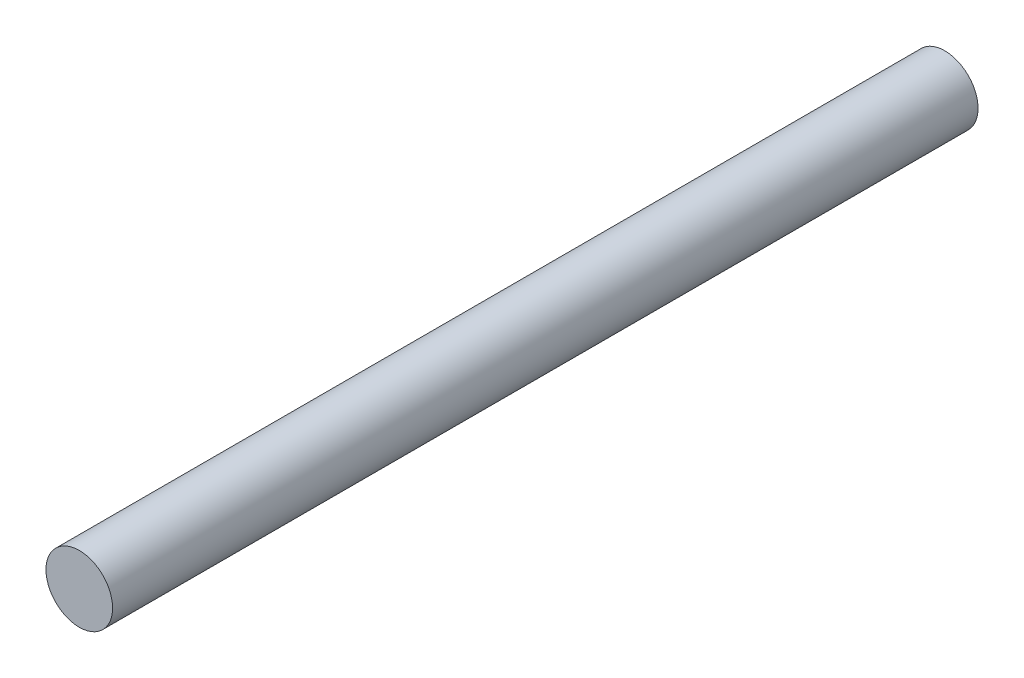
ISO-10303-21;
HEADER;
FILE_DESCRIPTION(('STEP AP214'),'2;1');
FILE_NAME('part.step','',(''),(''),'','','');
FILE_SCHEMA(('AUTOMOTIVE_DESIGN { 1 0 10303 214 1 1 1 1 }'));
ENDSEC;
DATA;
#1=APPLICATION_CONTEXT('core data for automotive mechanical design processes');
#2=APPLICATION_PROTOCOL_DEFINITION('international standard','automotive_design',2000,#1);
#3=PRODUCT_CONTEXT('',#1,'mechanical');
#4=PRODUCT('Part','Part','',(#3));
#5=PRODUCT_RELATED_PRODUCT_CATEGORY('part','',(#4));
#6=PRODUCT_DEFINITION_FORMATION('','',#4);
#7=PRODUCT_DEFINITION_CONTEXT('part definition',#1,'design');
#8=PRODUCT_DEFINITION('design','',#6,#7);
#9=PRODUCT_DEFINITION_SHAPE('','',#8);
#10=(LENGTH_UNIT() NAMED_UNIT(*) SI_UNIT(.MILLI.,.METRE.));
#11=(NAMED_UNIT(*) PLANE_ANGLE_UNIT() SI_UNIT($,.RADIAN.));
#12=(NAMED_UNIT(*) SI_UNIT($,.STERADIAN.) SOLID_ANGLE_UNIT());
#13=UNCERTAINTY_MEASURE_WITH_UNIT(LENGTH_MEASURE(1.E-05),#10,'distance_accuracy_value','');
#14=(GEOMETRIC_REPRESENTATION_CONTEXT(3) GLOBAL_UNCERTAINTY_ASSIGNED_CONTEXT((#13)) GLOBAL_UNIT_ASSIGNED_CONTEXT((#10,
#11,#12)) REPRESENTATION_CONTEXT('',''));
#15=CARTESIAN_POINT('',(0.,0.,0.));
#16=DIRECTION('',(0.,0.,1.));
#17=DIRECTION('',(1.,0.,0.));
#18=AXIS2_PLACEMENT_3D('',#15,#16,#17);
#19=CARTESIAN_POINT('',(1.07322330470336,0.,0.));
#20=DIRECTION('',(0.,0.,-1.));
#21=DIRECTION('',(-1.,0.,0.));
#22=AXIS2_PLACEMENT_3D('',#19,#20,#21);
#23=PLANE('',#22);
#24=CARTESIAN_POINT('',(0.,0.,0.));
#25=DIRECTION('',(0.,0.,-1.));
#26=DIRECTION('',(-1.,0.,0.));
#27=AXIS2_PLACEMENT_3D('',#24,#25,#26);
#28=CIRCLE('',#27,2.5);
#29=CARTESIAN_POINT('',(-2.5,0.,0.));
#30=VERTEX_POINT('',#29);
#31=EDGE_CURVE('E18',#30,#30,#28,.T.);
#32=ORIENTED_EDGE('',*,*,#31,.T.);
#33=EDGE_LOOP('',(#32));
#34=FACE_BOUND('',#33,.T.);
#35=ADVANCED_FACE('F12',(#34),#23,.T.);
#36=CARTESIAN_POINT('',(0.,0.,32.5));
#37=DIRECTION('',(0.,0.,-1.));
#38=DIRECTION('',(-1.,0.,0.));
#39=AXIS2_PLACEMENT_3D('',#36,#37,#38);
#40=CYLINDRICAL_SURFACE('',#39,2.5);
#41=CARTESIAN_POINT('',(0.,0.,65.));
#42=DIRECTION('',(0.,0.,1.));
#43=DIRECTION('',(1.,0.,0.));
#44=AXIS2_PLACEMENT_3D('',#41,#42,#43);
#45=CIRCLE('',#44,2.5);
#46=CARTESIAN_POINT('',(2.5,0.,65.));
#47=VERTEX_POINT('',#46);
#48=EDGE_CURVE('E8',#47,#47,#45,.F.);
#49=ORIENTED_EDGE('',*,*,#48,.T.);
#50=EDGE_LOOP('',(#49));
#51=FACE_BOUND('',#50,.T.);
#52=ORIENTED_EDGE('',*,*,#31,.F.);
#53=EDGE_LOOP('',(#52));
#54=FACE_BOUND('',#53,.T.);
#55=ADVANCED_FACE('F25',(#51,#54),#40,.T.);
#56=CARTESIAN_POINT('',(1.07322330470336,0.,65.));
#57=DIRECTION('',(0.,0.,1.));
#58=DIRECTION('',(1.,0.,0.));
#59=AXIS2_PLACEMENT_3D('',#56,#57,#58);
#60=PLANE('',#59);
#61=ORIENTED_EDGE('',*,*,#48,.F.);
#62=EDGE_LOOP('',(#61));
#63=FACE_BOUND('',#62,.T.);
#64=ADVANCED_FACE('F27',(#63),#60,.T.);
#65=CLOSED_SHELL('',(#35,#55,#64));
#66=MANIFOLD_SOLID_BREP('B1',#65);
#67=ADVANCED_BREP_SHAPE_REPRESENTATION('',(#18,#66),#14);
#68=SHAPE_DEFINITION_REPRESENTATION(#9,#67);
ENDSEC;
END-ISO-10303-21;
